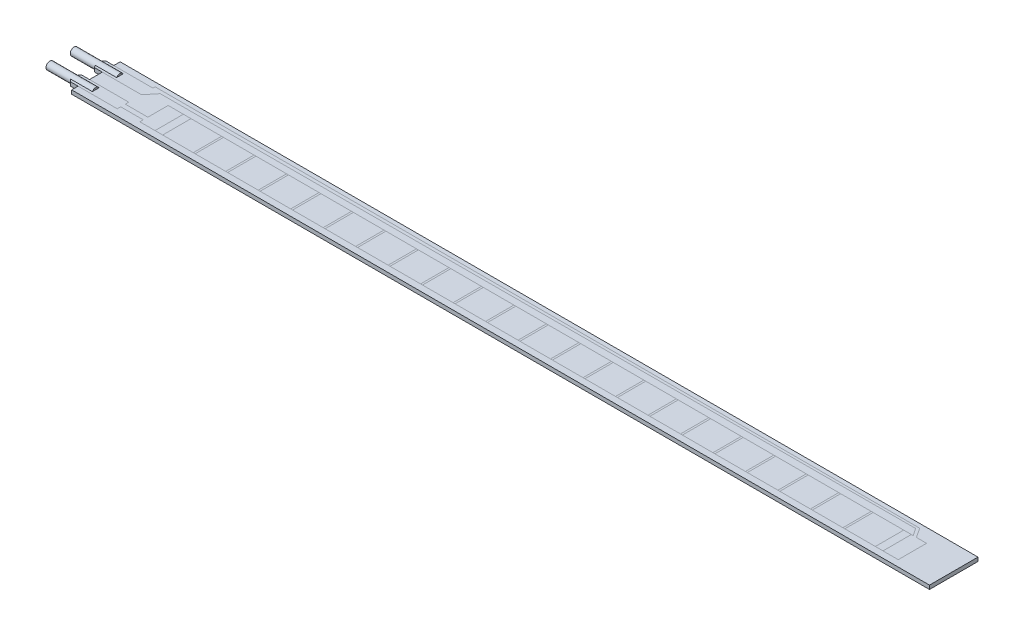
from build123d import *

# Parameters (mm, degrees)
SKETCH1_W                = 112.24
SKETCH1_H                = 6.35
BOSS_EXTRUDE1_DEPTH      = 0.5
BOSS_EXTRUDE2_DEPTH      = 0.5
BOSS_EXTRUDE3_DEPTH      = 3
BOSS_EXTRUDE3_DEPTH_BACK = 3
SKETCH6_R                = 0.5


with BuildPart() as part:
    # Sketch1 → Boss-Extrude1 (new body)
    with BuildSketch(Plane(origin=(0, 0, 0), x_dir=(1, 0, 0), z_dir=(0, 1, 0))):
        Rectangle(SKETCH1_W, SKETCH1_H)
    extrude(amount=BOSS_EXTRUDE1_DEPTH)

    # Sketch5 → Boss-Extrude2 (add)
    with BuildSketch(Plane(origin=(0, 0.5, 0), x_dir=(1, 0, 0), z_dir=(0, 1, 0))):
        Polygon((-56.12, -2.3375), (-57.133154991, -2.3375), (-57.563090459, -1.822005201), (-57.563090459, -1.352994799), (-57.133154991, -0.8375), (-56.12, -0.8375), align=None)
        Polygon((-57.563090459, 1.352994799), (-57.563090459, 1.822005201), (-57.133154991, 2.3375), (-56.12, 2.3375), (-56.12, 0.8375), (-57.133154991, 0.8375), align=None)
    extrude(amount=-BOSS_EXTRUDE2_DEPTH)

    # Sketch6 → Boss-Extrude3 (add, two sides: drawn at the far end of the back side and taken through both)
    with BuildSketch(Plane.ZY.offset(57.563090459).offset(-BOSS_EXTRUDE3_DEPTH_BACK)):
        with Locations((1.5875, 0.25)):
            Circle(SKETCH6_R)
        with Locations(Location((-1.5875, 0.25, 0), (0, 0, 30))):
            Circle(SKETCH6_R)
    extrude(amount=BOSS_EXTRUDE3_DEPTH + BOSS_EXTRUDE3_DEPTH_BACK)


solid = part.part
